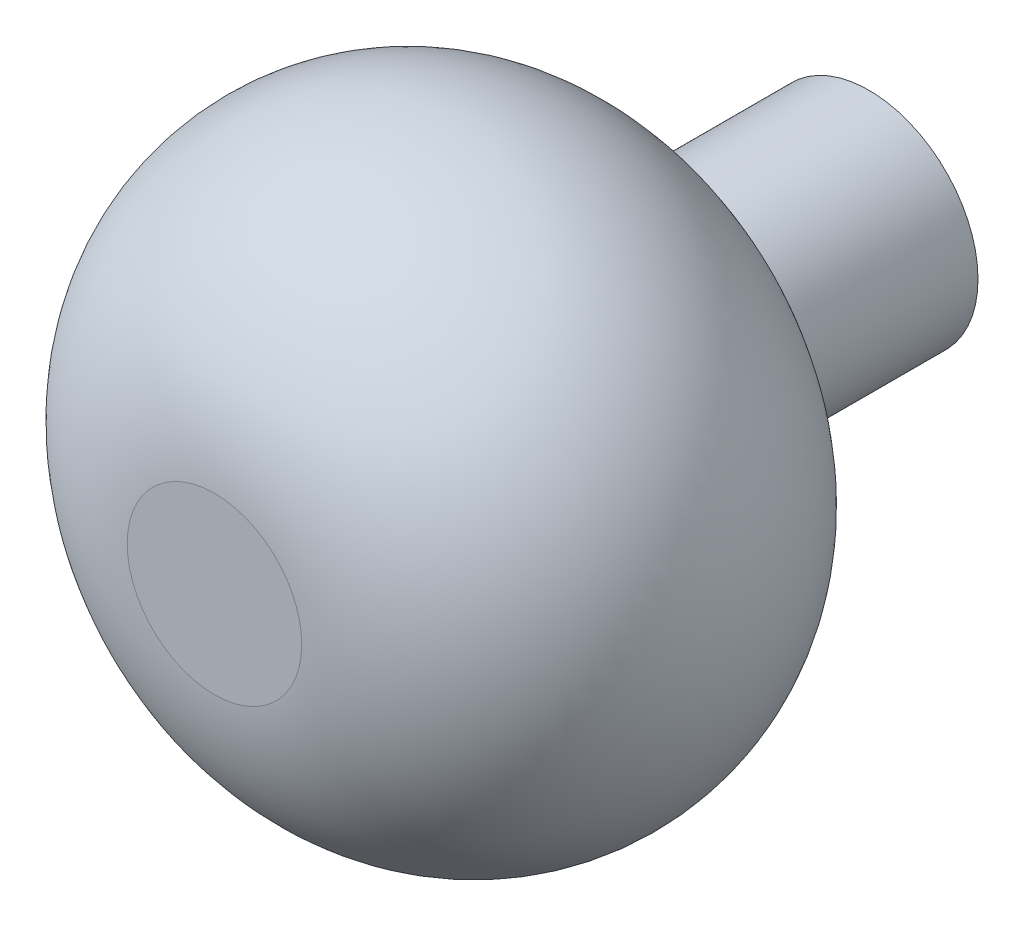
ISO-10303-21;
HEADER;
FILE_DESCRIPTION(('STEP AP214'),'2;1');
FILE_NAME('part.step','',(''),(''),'','','');
FILE_SCHEMA(('AUTOMOTIVE_DESIGN { 1 0 10303 214 1 1 1 1 }'));
ENDSEC;
DATA;
#1=APPLICATION_CONTEXT('core data for automotive mechanical design processes');
#2=APPLICATION_PROTOCOL_DEFINITION('international standard','automotive_design',2000,#1);
#3=PRODUCT_CONTEXT('',#1,'mechanical');
#4=PRODUCT('Part','Part','',(#3));
#5=PRODUCT_RELATED_PRODUCT_CATEGORY('part','',(#4));
#6=PRODUCT_DEFINITION_FORMATION('','',#4);
#7=PRODUCT_DEFINITION_CONTEXT('part definition',#1,'design');
#8=PRODUCT_DEFINITION('design','',#6,#7);
#9=PRODUCT_DEFINITION_SHAPE('','',#8);
#10=(LENGTH_UNIT() NAMED_UNIT(*) SI_UNIT(.MILLI.,.METRE.));
#11=(NAMED_UNIT(*) PLANE_ANGLE_UNIT() SI_UNIT($,.RADIAN.));
#12=(NAMED_UNIT(*) SI_UNIT($,.STERADIAN.) SOLID_ANGLE_UNIT());
#13=UNCERTAINTY_MEASURE_WITH_UNIT(LENGTH_MEASURE(1.E-05),#10,'distance_accuracy_value','');
#14=(GEOMETRIC_REPRESENTATION_CONTEXT(3) GLOBAL_UNCERTAINTY_ASSIGNED_CONTEXT((#13)) GLOBAL_UNIT_ASSIGNED_CONTEXT((#10,
#11,#12)) REPRESENTATION_CONTEXT('',''));
#15=CARTESIAN_POINT('',(0.,0.,0.));
#16=DIRECTION('',(0.,0.,1.));
#17=DIRECTION('',(1.,0.,0.));
#18=AXIS2_PLACEMENT_3D('',#15,#16,#17);
#19=CARTESIAN_POINT('',(0.,6.35,0.));
#20=DIRECTION('',(0.,0.,-1.));
#21=DIRECTION('',(-1.,0.,0.));
#22=AXIS2_PLACEMENT_3D('',#19,#20,#21);
#23=PLANE('',#22);
#24=CARTESIAN_POINT('',(0.,0.,0.));
#25=DIRECTION('',(0.,0.,-1.));
#26=DIRECTION('',(-1.,0.,0.));
#27=AXIS2_PLACEMENT_3D('',#24,#25,#26);
#28=CIRCLE('',#27,6.35);
#29=CARTESIAN_POINT('',(-6.35,0.,0.));
#30=VERTEX_POINT('',#29);
#31=EDGE_CURVE('E41',#30,#30,#28,.T.);
#32=ORIENTED_EDGE('',*,*,#31,.T.);
#33=EDGE_LOOP('',(#32));
#34=FACE_BOUND('',#33,.T.);
#35=ADVANCED_FACE('F31',(#34),#23,.T.);
#36=CARTESIAN_POINT('',(0.,0.,38.1));
#37=DIRECTION('',(0.,0.,1.));
#38=DIRECTION('',(1.,0.,0.));
#39=AXIS2_PLACEMENT_3D('',#36,#37,#38);
#40=PLANE('',#39);
#41=CARTESIAN_POINT('',(0.,0.,38.1));
#42=DIRECTION('',(0.,0.,-1.));
#43=DIRECTION('',(-1.,0.,0.));
#44=AXIS2_PLACEMENT_3D('',#41,#42,#43);
#45=CIRCLE('',#44,5.08);
#46=CARTESIAN_POINT('',(-5.08,0.,38.1));
#47=VERTEX_POINT('',#46);
#48=EDGE_CURVE('E10',#47,#47,#45,.T.);
#49=ORIENTED_EDGE('',*,*,#48,.F.);
#50=EDGE_LOOP('',(#49));
#51=FACE_BOUND('',#50,.T.);
#52=ADVANCED_FACE('F56',(#51),#40,.T.);
#53=CARTESIAN_POINT('',(0.,0.,24.899887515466));
#54=DIRECTION('',(0.,0.,-1.));
#55=DIRECTION('',(-1.,0.,0.));
#56=AXIS2_PLACEMENT_3D('',#53,#54,#55);
#57=DEGENERATE_TOROIDAL_SURFACE('',#56,4.31341614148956,13.2223530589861,.T.);
#58=ORIENTED_EDGE('',*,*,#48,.T.);
#59=EDGE_LOOP('',(#58));
#60=FACE_BOUND('',#59,.T.);
#61=CARTESIAN_POINT('',(0.,0.,11.8353191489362));
#62=DIRECTION('',(0.,0.,-1.));
#63=DIRECTION('',(-1.,0.,0.));
#64=AXIS2_PLACEMENT_3D('',#61,#62,#63);
#65=CIRCLE('',#64,6.35);
#66=CARTESIAN_POINT('',(-6.35,0.,11.8353191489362));
#67=VERTEX_POINT('',#66);
#68=EDGE_CURVE('E37',#67,#67,#65,.T.);
#69=ORIENTED_EDGE('',*,*,#68,.F.);
#70=EDGE_LOOP('',(#69));
#71=FACE_BOUND('',#70,.T.);
#72=ADVANCED_FACE('F51',(#60,#71),#57,.T.);
#73=CARTESIAN_POINT('',(0.,0.,0.));
#74=DIRECTION('',(0.,0.,-1.));
#75=DIRECTION('',(-1.,0.,0.));
#76=AXIS2_PLACEMENT_3D('',#73,#74,#75);
#77=CYLINDRICAL_SURFACE('',#76,6.35);
#78=ORIENTED_EDGE('',*,*,#68,.T.);
#79=EDGE_LOOP('',(#78));
#80=FACE_BOUND('',#79,.T.);
#81=ORIENTED_EDGE('',*,*,#31,.F.);
#82=EDGE_LOOP('',(#81));
#83=FACE_BOUND('',#82,.T.);
#84=ADVANCED_FACE('F49',(#80,#83),#77,.T.);
#85=CLOSED_SHELL('',(#35,#52,#72,#84));
#86=MANIFOLD_SOLID_BREP('B2',#85);
#87=ADVANCED_BREP_SHAPE_REPRESENTATION('',(#18,#86),#14);
#88=SHAPE_DEFINITION_REPRESENTATION(#9,#87);
ENDSEC;
END-ISO-10303-21;
